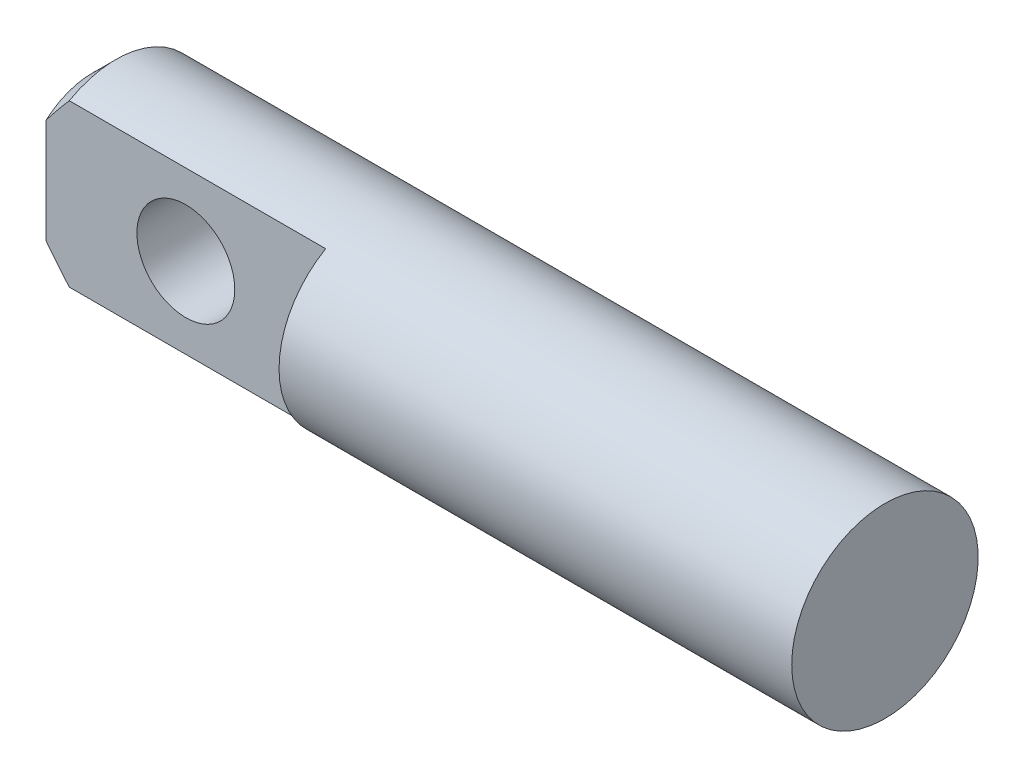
ISO-10303-21;
HEADER;
FILE_DESCRIPTION(('STEP AP214'),'2;1');
FILE_NAME('part.step','',(''),(''),'','','');
FILE_SCHEMA(('AUTOMOTIVE_DESIGN { 1 0 10303 214 1 1 1 1 }'));
ENDSEC;
DATA;
#1=APPLICATION_CONTEXT('core data for automotive mechanical design processes');
#2=APPLICATION_PROTOCOL_DEFINITION('international standard','automotive_design',2000,#1);
#3=PRODUCT_CONTEXT('',#1,'mechanical');
#4=PRODUCT('Part','Part','',(#3));
#5=PRODUCT_RELATED_PRODUCT_CATEGORY('part','',(#4));
#6=PRODUCT_DEFINITION_FORMATION('','',#4);
#7=PRODUCT_DEFINITION_CONTEXT('part definition',#1,'design');
#8=PRODUCT_DEFINITION('design','',#6,#7);
#9=PRODUCT_DEFINITION_SHAPE('','',#8);
#10=(LENGTH_UNIT() NAMED_UNIT(*) SI_UNIT(.MILLI.,.METRE.));
#11=(NAMED_UNIT(*) PLANE_ANGLE_UNIT() SI_UNIT($,.RADIAN.));
#12=(NAMED_UNIT(*) SI_UNIT($,.STERADIAN.) SOLID_ANGLE_UNIT());
#13=UNCERTAINTY_MEASURE_WITH_UNIT(LENGTH_MEASURE(1.E-05),#10,'distance_accuracy_value','');
#14=(GEOMETRIC_REPRESENTATION_CONTEXT(3) GLOBAL_UNCERTAINTY_ASSIGNED_CONTEXT((#13)) GLOBAL_UNIT_ASSIGNED_CONTEXT((#10,
#11,#12)) REPRESENTATION_CONTEXT('',''));
#15=CARTESIAN_POINT('',(0.,0.,0.));
#16=DIRECTION('',(0.,0.,1.));
#17=DIRECTION('',(1.,0.,0.));
#18=AXIS2_PLACEMENT_3D('',#15,#16,#17);
#19=CARTESIAN_POINT('',(0.,0.,0.));
#20=DIRECTION('',(1.,0.,0.));
#21=DIRECTION('',(0.,0.,-1.));
#22=AXIS2_PLACEMENT_3D('',#19,#20,#21);
#23=PLANE('',#22);
#24=CARTESIAN_POINT('',(0.,0.,0.));
#25=DIRECTION('',(-1.,0.,0.));
#26=DIRECTION('',(0.,0.,1.));
#27=AXIS2_PLACEMENT_3D('',#24,#25,#26);
#28=CIRCLE('',#27,1.5);
#29=CARTESIAN_POINT('',(0.,1.11803398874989,1.));
#30=VERTEX_POINT('',#29);
#31=CARTESIAN_POINT('',(0.,-1.11803398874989,1.));
#32=VERTEX_POINT('',#31);
#33=EDGE_CURVE('E11',#30,#32,#28,.T.);
#34=ORIENTED_EDGE('',*,*,#33,.T.);
#35=DIRECTION('',(0.,-1.,0.));
#36=VECTOR('',#35,1.);
#37=CARTESIAN_POINT('',(0.,1.73205080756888,1.));
#38=LINE('',#37,#36);
#39=EDGE_CURVE('E68',#30,#32,#38,.T.);
#40=ORIENTED_EDGE('',*,*,#39,.F.);
#41=EDGE_LOOP('',(#34,#40));
#42=FACE_BOUND('',#41,.T.);
#43=ADVANCED_FACE('F32',(#42),#23,.F.);
#44=CARTESIAN_POINT('',(0.5,0.,0.));
#45=DIRECTION('',(1.,0.,0.));
#46=DIRECTION('',(0.,0.,-1.));
#47=AXIS2_PLACEMENT_3D('',#44,#45,#46);
#48=CONICAL_SURFACE('',#47,2.,0.785398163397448);
#49=CARTESIAN_POINT('',(0.5,0.,0.));
#50=DIRECTION('',(-1.,0.,0.));
#51=DIRECTION('',(0.,0.,1.));
#52=AXIS2_PLACEMENT_3D('',#49,#50,#51);
#53=CIRCLE('',#52,2.);
#54=CARTESIAN_POINT('',(0.5,1.73205080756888,1.));
#55=VERTEX_POINT('',#54);
#56=CARTESIAN_POINT('',(0.5,-1.73205080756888,1.));
#57=VERTEX_POINT('',#56);
#58=EDGE_CURVE('E39',#55,#57,#53,.T.);
#59=ORIENTED_EDGE('',*,*,#58,.T.);
#60=CARTESIAN_POINT('',(2.46057398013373,-3.83225080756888,1.));
#61=CARTESIAN_POINT('',(2.37587400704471,-3.74471120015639,1.));
#62=CARTESIAN_POINT('',(2.2912658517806,-3.65708252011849,1.));
#63=CARTESIAN_POINT('',(2.12228498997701,-3.4815963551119,1.));
#64=CARTESIAN_POINT('',(2.03791228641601,-3.39373886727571,1.));
#65=CARTESIAN_POINT('',(1.78513969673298,-3.12965797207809,1.));
#66=CARTESIAN_POINT('',(1.61717451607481,-2.95301808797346,1.));
#67=CARTESIAN_POINT('',(1.28648900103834,-2.60155131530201,1.));
#68=CARTESIAN_POINT('',(1.12373125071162,-2.42675985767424,1.));
#69=CARTESIAN_POINT('',(0.882095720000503,-2.16232006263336,1.));
#70=CARTESIAN_POINT('',(0.801976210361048,-2.07380805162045,1.));
#71=CARTESIAN_POINT('',(0.642927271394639,-1.89572176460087,1.));
#72=CARTESIAN_POINT('',(0.563997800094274,-1.80614752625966,1.));
#73=CARTESIAN_POINT('',(0.438831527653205,-1.6612689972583,1.));
#74=CARTESIAN_POINT('',(0.39203362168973,-1.60645005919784,1.));
#75=CARTESIAN_POINT('',(0.299278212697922,-1.49609455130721,1.));
#76=CARTESIAN_POINT('',(0.253320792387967,-1.44055791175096,1.));
#77=CARTESIAN_POINT('',(0.162051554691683,-1.32797390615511,1.));
#78=CARTESIAN_POINT('',(0.116751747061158,-1.27091676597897,1.));
#79=CARTESIAN_POINT('',(0.0277454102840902,-1.15557501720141,1.));
#80=CARTESIAN_POINT('',(-0.0159612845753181,-1.09729053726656,1.));
#81=CARTESIAN_POINT('',(-0.101758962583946,-0.978170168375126,1.));
#82=CARTESIAN_POINT('',(-0.143814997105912,-0.917308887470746,1.));
#83=CARTESIAN_POINT('',(-0.224490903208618,-0.793192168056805,1.));
#84=CARTESIAN_POINT('',(-0.263106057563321,-0.729933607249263,1.));
#85=CARTESIAN_POINT('',(-0.334439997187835,-0.601150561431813,1.));
#86=CARTESIAN_POINT('',(-0.367226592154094,-0.535664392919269,1.));
#87=CARTESIAN_POINT('',(-0.424260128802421,-0.401101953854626,1.));
#88=CARTESIAN_POINT('',(-0.448535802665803,-0.332038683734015,1.));
#89=CARTESIAN_POINT('',(-0.474733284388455,-0.228445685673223,1.));
#90=CARTESIAN_POINT('',(-0.481668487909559,-0.19518216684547,1.));
#91=CARTESIAN_POINT('',(-0.492365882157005,-0.12813924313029,1.));
#92=CARTESIAN_POINT('',(-0.496128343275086,-0.0943598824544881,1.));
#93=CARTESIAN_POINT('',(-0.500211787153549,-0.0266892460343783,1.));
#94=CARTESIAN_POINT('',(-0.50054295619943,0.00720139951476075,1.));
#95=CARTESIAN_POINT('',(-0.497775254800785,0.0748350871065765,1.));
#96=CARTESIAN_POINT('',(-0.494676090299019,0.108578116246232,1.));
#97=CARTESIAN_POINT('',(-0.480599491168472,0.20851256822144,1.));
#98=CARTESIAN_POINT('',(-0.464876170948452,0.27406631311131,1.));
#99=CARTESIAN_POINT('',(-0.434150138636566,0.370108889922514,1.));
#100=CARTESIAN_POINT('',(-0.422668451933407,0.401841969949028,1.));
#101=CARTESIAN_POINT('',(-0.39774448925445,0.464529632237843,1.));
#102=CARTESIAN_POINT('',(-0.384302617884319,0.495484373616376,1.));
#103=CARTESIAN_POINT('',(-0.341227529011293,0.58802936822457,1.));
#104=CARTESIAN_POINT('',(-0.309132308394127,0.648465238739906,1.));
#105=CARTESIAN_POINT('',(-0.240704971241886,0.766913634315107,1.));
#106=CARTESIAN_POINT('',(-0.204367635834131,0.824923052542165,1.));
#107=CARTESIAN_POINT('',(-0.128719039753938,0.939284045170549,1.));
#108=CARTESIAN_POINT('',(-0.0893965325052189,0.995628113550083,1.));
#109=CARTESIAN_POINT('',(-0.00880708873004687,1.10685190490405,1.));
#110=CARTESIAN_POINT('',(0.0324588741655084,1.1617323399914,1.));
#111=CARTESIAN_POINT('',(0.116950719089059,1.27112215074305,1.));
#112=CARTESIAN_POINT('',(0.160195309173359,1.32561700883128,1.));
#113=CARTESIAN_POINT('',(0.247749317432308,1.4337464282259,1.));
#114=CARTESIAN_POINT('',(0.292058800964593,1.48738093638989,1.));
#115=CARTESIAN_POINT('',(0.425958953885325,1.64702819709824,1.));
#116=CARTESIAN_POINT('',(0.51673012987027,1.75204921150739,1.));
#117=CARTESIAN_POINT('',(0.684562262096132,1.94266875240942,1.));
#118=CARTESIAN_POINT('',(0.761327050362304,2.02853055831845,1.));
#119=CARTESIAN_POINT('',(0.915795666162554,2.19940947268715,1.));
#120=CARTESIAN_POINT('',(0.993499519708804,2.2844265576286,1.));
#121=CARTESIAN_POINT('',(1.22775950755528,2.53871324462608,1.));
#122=CARTESIAN_POINT('',(1.38531948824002,2.70705628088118,1.));
#123=CARTESIAN_POINT('',(1.69545643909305,3.03540360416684,1.));
#124=CARTESIAN_POINT('',(1.84797198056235,3.1954661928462,1.));
#125=CARTESIAN_POINT('',(2.077347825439,3.43481167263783,1.));
#126=CARTESIAN_POINT('',(2.1538640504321,3.51442460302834,1.));
#127=CARTESIAN_POINT('',(2.307086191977,3.67346650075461,1.));
#128=CARTESIAN_POINT('',(2.38379210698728,3.75289546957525,1.));
#129=CARTESIAN_POINT('',(2.46057398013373,3.83225080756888,1.));
#130=B_SPLINE_CURVE_WITH_KNOTS('',3,(#60,#61,#62,#63,#64,#65,#66,#67,#68,#69,#70,#71,#72,#73,
#74,#75,#76,#77,#78,#79,#80,#81,#82,#83,#84,#85,#86,#87,#88,#89,#90,#91,#92,#93,#94,#95,#96,#97,
#98,#99,#100,#101,#102,#103,#104,#105,#106,#107,#108,#109,#110,#111,#112,#113,#114,#115,#116,
#117,#118,#119,#120,#121,#122,#123,#124,#125,#126,#127,#128,#129),.UNSPECIFIED.,.F.,.F.,(4,2,2,
2,2,2,2,2,2,2,2,2,2,2,2,2,2,2,2,2,2,2,2,2,2,2,2,2,2,2,2,2,2,2,4),(0.,0.365425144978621,
0.730854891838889,1.46209867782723,2.17857445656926,2.536732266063,2.89487741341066,
3.1111036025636,3.32735095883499,3.54589088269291,3.76440800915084,3.98626822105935,
4.20842805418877,4.42780463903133,4.6464333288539,4.74824013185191,4.8500382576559,
4.95153409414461,5.05303863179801,5.25410882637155,5.35530965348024,5.45648962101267,
5.66148363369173,5.86673255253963,6.07279728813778,6.27875986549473,6.48744761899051,
6.69614821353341,7.11253886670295,7.45805536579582,7.80358145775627,8.49528494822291,
9.15855260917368,9.48981739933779,9.82107950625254),.UNSPECIFIED.);
#131=EDGE_CURVE('E52',#57,#32,#130,.T.);
#132=ORIENTED_EDGE('',*,*,#131,.T.);
#133=ORIENTED_EDGE('',*,*,#33,.F.);
#134=EDGE_CURVE('E80',#30,#55,#130,.T.);
#135=ORIENTED_EDGE('',*,*,#134,.T.);
#136=EDGE_LOOP('',(#59,#132,#133,#135));
#137=FACE_BOUND('',#136,.T.);
#138=ADVANCED_FACE('F90',(#137),#48,.T.);
#139=CARTESIAN_POINT('',(0.,0.,0.));
#140=DIRECTION('',(-1.,0.,0.));
#141=DIRECTION('',(0.,0.,1.));
#142=AXIS2_PLACEMENT_3D('',#139,#140,#141);
#143=CYLINDRICAL_SURFACE('',#142,2.);
#144=CARTESIAN_POINT('',(4.05,0.,-2.));
#145=CARTESIAN_POINT('',(4.04999642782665,0.0548641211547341,-1.99999683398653));
#146=CARTESIAN_POINT('',(4.04567479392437,0.109783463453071,-1.99771881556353));
#147=CARTESIAN_POINT('',(4.02858955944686,0.217977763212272,-1.98883014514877));
#148=CARTESIAN_POINT('',(4.01581212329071,0.271249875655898,-1.98221239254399));
#149=CARTESIAN_POINT('',(3.98246345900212,0.374423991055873,-1.96533181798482));
#150=CARTESIAN_POINT('',(3.96192347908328,0.424338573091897,-1.95508362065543));
#151=CARTESIAN_POINT('',(3.91380632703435,0.519927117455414,-1.93186406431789));
#152=CARTESIAN_POINT('',(3.88622926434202,0.565601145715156,-1.9188927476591));
#153=CARTESIAN_POINT('',(3.82280240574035,0.654735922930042,-1.89040981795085));
#154=CARTESIAN_POINT('',(3.78653272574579,0.697862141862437,-1.87478813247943));
#155=CARTESIAN_POINT('',(3.70766284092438,0.777732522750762,-1.84309034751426));
#156=CARTESIAN_POINT('',(3.66505733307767,0.814471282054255,-1.8270138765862));
#157=CARTESIAN_POINT('',(3.57026208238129,0.883766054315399,-1.79458801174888));
#158=CARTESIAN_POINT('',(3.51755955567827,0.915672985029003,-1.77833825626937));
#159=CARTESIAN_POINT('',(3.40661050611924,0.97003900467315,-1.74927996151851));
#160=CARTESIAN_POINT('',(3.34836824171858,0.992505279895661,-1.73646880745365));
#161=CARTESIAN_POINT('',(3.23163455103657,1.02581389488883,-1.71699156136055));
#162=CARTESIAN_POINT('',(3.17338254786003,1.03729066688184,-1.70999366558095));
#163=CARTESIAN_POINT('',(3.05539598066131,1.05021032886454,-1.70209360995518));
#164=CARTESIAN_POINT('',(2.99566326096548,1.05166512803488,-1.70118421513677));
#165=CARTESIAN_POINT('',(2.88511792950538,1.04496287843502,-1.70530281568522));
#166=CARTESIAN_POINT('',(2.83419117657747,1.03807876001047,-1.70954469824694));
#167=CARTESIAN_POINT('',(2.73435992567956,1.01712241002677,-1.72209458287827));
#168=CARTESIAN_POINT('',(2.68545620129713,1.00304745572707,-1.73040412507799));
#169=CARTESIAN_POINT('',(2.58966972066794,0.96788100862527,-1.75032008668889));
#170=CARTESIAN_POINT('',(2.54285841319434,0.946636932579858,-1.76199731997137));
#171=CARTESIAN_POINT('',(2.4532306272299,0.897858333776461,-1.78734588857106));
#172=CARTESIAN_POINT('',(2.4104159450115,0.870321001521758,-1.80101811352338));
#173=CARTESIAN_POINT('',(2.3236097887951,0.805196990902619,-1.8311522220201));
#174=CARTESIAN_POINT('',(2.28031136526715,0.766739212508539,-1.84773486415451));
#175=CARTESIAN_POINT('',(2.20047253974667,0.683082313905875,-1.88026963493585));
#176=CARTESIAN_POINT('',(2.16393602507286,0.637879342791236,-1.89622139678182));
#177=CARTESIAN_POINT('',(2.09670893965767,0.538834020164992,-1.9267817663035));
#178=CARTESIAN_POINT('',(2.06646076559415,0.48464945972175,-1.94126499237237));
#179=CARTESIAN_POINT('',(2.0157686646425,0.371011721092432,-1.96614386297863));
#180=CARTESIAN_POINT('',(1.99531622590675,0.311563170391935,-1.97654305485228));
#181=CARTESIAN_POINT('',(1.96661366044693,0.194698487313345,-1.9912936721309));
#182=CARTESIAN_POINT('',(1.9574465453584,0.137565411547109,-1.99609753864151));
#183=CARTESIAN_POINT('',(1.94865342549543,0.0223804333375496,-2.00070334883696));
#184=CARTESIAN_POINT('',(1.94902217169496,-0.0356709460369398,-2.00050804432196));
#185=CARTESIAN_POINT('',(1.95881362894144,-0.145639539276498,-1.9953836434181));
#186=CARTESIAN_POINT('',(1.96744311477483,-0.197649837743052,-1.99086929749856));
#187=CARTESIAN_POINT('',(1.99221937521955,-0.29936409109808,-1.97813273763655));
#188=CARTESIAN_POINT('',(2.0083669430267,-0.349067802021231,-1.96991013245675));
#189=CARTESIAN_POINT('',(2.04807212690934,-0.446276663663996,-1.95022110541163));
#190=CARTESIAN_POINT('',(2.07181153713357,-0.493691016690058,-1.93867588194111));
#191=CARTESIAN_POINT('',(2.1258095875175,-0.584005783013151,-1.91341051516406));
#192=CARTESIAN_POINT('',(2.15607084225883,-0.626904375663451,-1.89968950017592));
#193=CARTESIAN_POINT('',(2.22591727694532,-0.711777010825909,-1.86965424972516));
#194=CARTESIAN_POINT('',(2.26614906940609,-0.753176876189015,-1.85321912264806));
#195=CARTESIAN_POINT('',(2.35292568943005,-0.828924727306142,-1.82060103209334));
#196=CARTESIAN_POINT('',(2.39947593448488,-0.863266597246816,-1.80441829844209));
#197=CARTESIAN_POINT('',(2.50116779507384,-0.925987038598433,-1.77309145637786));
#198=CARTESIAN_POINT('',(2.55666411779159,-0.953860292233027,-1.75807501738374));
#199=CARTESIAN_POINT('',(2.6725806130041,-0.999581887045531,-1.73249279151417));
#200=CARTESIAN_POINT('',(2.73299376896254,-1.01744423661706,-1.72192079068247));
#201=CARTESIAN_POINT('',(2.85074524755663,-1.04089614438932,-1.70783667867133));
#202=CARTESIAN_POINT('',(2.90780551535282,-1.04751606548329,-1.70373469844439));
#203=CARTESIAN_POINT('',(3.02234654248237,-1.05132201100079,-1.70139066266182));
#204=CARTESIAN_POINT('',(3.07982702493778,-1.04851377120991,-1.70314504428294));
#205=CARTESIAN_POINT('',(3.1865848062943,-1.03452866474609,-1.71166640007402));
#206=CARTESIAN_POINT('',(3.2360471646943,-1.02434795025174,-1.71783575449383));
#207=CARTESIAN_POINT('',(3.33248041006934,-0.997229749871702,-1.7337180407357));
#208=CARTESIAN_POINT('',(3.37945040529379,-0.980289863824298,-1.74343223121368));
#209=CARTESIAN_POINT('',(3.47299828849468,-0.938913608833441,-1.76607769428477));
#210=CARTESIAN_POINT('',(3.51934879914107,-0.914058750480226,-1.77917806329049));
#211=CARTESIAN_POINT('',(3.60753120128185,-0.857985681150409,-1.80688642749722));
#212=CARTESIAN_POINT('',(3.6493606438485,-0.826764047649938,-1.8214952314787));
#213=CARTESIAN_POINT('',(3.73336162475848,-0.753783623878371,-1.85299725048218));
#214=CARTESIAN_POINT('',(3.77477596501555,-0.711163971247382,-1.86992628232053));
#215=CARTESIAN_POINT('',(3.85007948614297,-0.619191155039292,-1.90236151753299));
#216=CARTESIAN_POINT('',(3.88396403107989,-0.569833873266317,-1.91786684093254));
#217=CARTESIAN_POINT('',(3.94371380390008,-0.464378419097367,-1.94612151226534));
#218=CARTESIAN_POINT('',(3.96941012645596,-0.408167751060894,-1.95881135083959));
#219=CARTESIAN_POINT('',(4.01063714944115,-0.291412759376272,-1.97953693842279));
#220=CARTESIAN_POINT('',(4.02619547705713,-0.230880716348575,-1.98758532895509));
#221=CARTESIAN_POINT('',(4.0408249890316,-0.141380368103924,-1.99519548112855));
#222=CARTESIAN_POINT('',(4.04425957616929,-0.113250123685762,-1.9969913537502));
#223=CARTESIAN_POINT('',(4.04884802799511,-0.0567515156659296,-1.99939444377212));
#224=CARTESIAN_POINT('',(4.05000184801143,-0.0283831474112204,-2.00000163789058));
#225=CARTESIAN_POINT('',(4.05,0.,-2.));
#226=B_SPLINE_CURVE_WITH_KNOTS('',3,(#144,#145,#146,#147,#148,#149,#150,#151,#152,#153,#154,
#155,#156,#157,#158,#159,#160,#161,#162,#163,#164,#165,#166,#167,#168,#169,#170,#171,#172,#173,
#174,#175,#176,#177,#178,#179,#180,#181,#182,#183,#184,#185,#186,#187,#188,#189,#190,#191,#192,
#193,#194,#195,#196,#197,#198,#199,#200,#201,#202,#203,#204,#205,#206,#207,#208,#209,#210,#211,
#212,#213,#214,#215,#216,#217,#218,#219,#220,#221,#222,#223,#224,#225),.UNSPECIFIED.,.T.,.F.,(4,
2,2,2,2,2,2,2,2,2,2,2,2,2,2,2,2,2,2,2,2,2,2,2,2,2,2,2,2,2,2,2,2,2,2,2,2,2,2,2,4),(0.,
0.164477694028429,0.329225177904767,0.493316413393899,0.657405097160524,0.832113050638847,
1.00696806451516,1.19715271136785,1.38719232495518,1.56544714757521,1.7434901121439,
1.89746165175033,2.05149153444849,2.209031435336,2.36664180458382,2.54658744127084,
2.72663620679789,2.91677576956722,3.10674981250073,3.27997148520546,3.45309780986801,
3.6111101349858,3.76913913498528,3.9312780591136,4.09348210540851,4.27278509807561,
4.45224280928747,4.64288973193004,4.83326920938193,5.0050093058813,5.17664494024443,
5.32860681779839,5.48062270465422,5.64259984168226,5.8046642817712,5.98920626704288,
6.17386155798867,6.36211058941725,6.5498444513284,6.63493290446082,6.72002302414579),.UNSPECIFIED.);
#227=CARTESIAN_POINT('',(4.05,0.,-2.));
#228=VERTEX_POINT('',#227);
#229=EDGE_CURVE('E106',#228,#228,#226,.T.);
#230=ORIENTED_EDGE('',*,*,#229,.T.);
#231=EDGE_LOOP('',(#230));
#232=FACE_BOUND('',#231,.T.);
#233=CARTESIAN_POINT('',(6.,0.,0.));
#234=DIRECTION('',(-1.,0.,0.));
#235=DIRECTION('',(0.,0.,1.));
#236=AXIS2_PLACEMENT_3D('',#233,#234,#235);
#237=CIRCLE('',#236,2.);
#238=CARTESIAN_POINT('',(6.,-1.73205080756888,1.));
#239=VERTEX_POINT('',#238);
#240=CARTESIAN_POINT('',(6.,1.73205080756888,1.));
#241=VERTEX_POINT('',#240);
#242=EDGE_CURVE('E64',#239,#241,#237,.T.);
#243=ORIENTED_EDGE('',*,*,#242,.F.);
#244=DIRECTION('',(-1.,0.,0.));
#245=VECTOR('',#244,1.);
#246=CARTESIAN_POINT('',(6.,-1.73205080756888,1.));
#247=LINE('',#246,#245);
#248=EDGE_CURVE('E73',#239,#57,#247,.T.);
#249=ORIENTED_EDGE('',*,*,#248,.T.);
#250=ORIENTED_EDGE('',*,*,#58,.F.);
#251=DIRECTION('',(-1.,0.,0.));
#252=VECTOR('',#251,1.);
#253=CARTESIAN_POINT('',(6.,1.73205080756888,1.));
#254=LINE('',#253,#252);
#255=EDGE_CURVE('E71',#241,#55,#254,.T.);
#256=ORIENTED_EDGE('',*,*,#255,.F.);
#257=EDGE_LOOP('',(#243,#249,#250,#256));
#258=FACE_BOUND('',#257,.T.);
#259=CARTESIAN_POINT('',(17.,0.,0.));
#260=DIRECTION('',(-1.,0.,0.));
#261=DIRECTION('',(0.,0.,1.));
#262=AXIS2_PLACEMENT_3D('',#259,#260,#261);
#263=CIRCLE('',#262,2.);
#264=CARTESIAN_POINT('',(17.,0.,2.));
#265=VERTEX_POINT('',#264);
#266=EDGE_CURVE('E89',#265,#265,#263,.T.);
#267=ORIENTED_EDGE('',*,*,#266,.T.);
#268=EDGE_LOOP('',(#267));
#269=FACE_BOUND('',#268,.T.);
#270=ADVANCED_FACE('F76',(#232,#258,#269),#143,.T.);
#271=CARTESIAN_POINT('',(17.,2.,0.));
#272=DIRECTION('',(-1.,0.,0.));
#273=DIRECTION('',(0.,0.,1.));
#274=AXIS2_PLACEMENT_3D('',#271,#272,#273);
#275=PLANE('',#274);
#276=ORIENTED_EDGE('',*,*,#266,.F.);
#277=EDGE_LOOP('',(#276));
#278=FACE_BOUND('',#277,.T.);
#279=ADVANCED_FACE('F97',(#278),#275,.F.);
#280=CARTESIAN_POINT('',(6.,1.73205080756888,1.));
#281=DIRECTION('',(0.,0.,-1.));
#282=DIRECTION('',(-1.,0.,0.));
#283=AXIS2_PLACEMENT_3D('',#280,#281,#282);
#284=PLANE('',#283);
#285=CARTESIAN_POINT('',(3.,0.,1.));
#286=DIRECTION('',(0.,0.,1.));
#287=DIRECTION('',(1.,0.,0.));
#288=AXIS2_PLACEMENT_3D('',#285,#286,#287);
#289=CIRCLE('',#288,1.05);
#290=CARTESIAN_POINT('',(4.05,0.,1.));
#291=VERTEX_POINT('',#290);
#292=EDGE_CURVE('E111',#291,#291,#289,.T.);
#293=ORIENTED_EDGE('',*,*,#292,.F.);
#294=EDGE_LOOP('',(#293));
#295=FACE_BOUND('',#294,.T.);
#296=ORIENTED_EDGE('',*,*,#248,.F.);
#297=DIRECTION('',(0.,-1.,0.));
#298=VECTOR('',#297,1.);
#299=CARTESIAN_POINT('',(6.,1.73205080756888,1.));
#300=LINE('',#299,#298);
#301=EDGE_CURVE('E45',#241,#239,#300,.T.);
#302=ORIENTED_EDGE('',*,*,#301,.F.);
#303=ORIENTED_EDGE('',*,*,#255,.T.);
#304=ORIENTED_EDGE('',*,*,#134,.F.);
#305=ORIENTED_EDGE('',*,*,#39,.T.);
#306=ORIENTED_EDGE('',*,*,#131,.F.);
#307=EDGE_LOOP('',(#296,#302,#303,#304,#305,#306));
#308=FACE_BOUND('',#307,.T.);
#309=ADVANCED_FACE('F70',(#295,#308),#284,.F.);
#310=CARTESIAN_POINT('',(6.,0.,0.));
#311=DIRECTION('',(-1.,0.,0.));
#312=DIRECTION('',(0.,0.,1.));
#313=AXIS2_PLACEMENT_3D('',#310,#311,#312);
#314=PLANE('',#313);
#315=ORIENTED_EDGE('',*,*,#242,.T.);
#316=ORIENTED_EDGE('',*,*,#301,.T.);
#317=EDGE_LOOP('',(#315,#316));
#318=FACE_BOUND('',#317,.T.);
#319=ADVANCED_FACE('F65',(#318),#314,.T.);
#320=CARTESIAN_POINT('',(3.,0.,-2.));
#321=DIRECTION('',(0.,0.,1.));
#322=DIRECTION('',(1.,0.,0.));
#323=AXIS2_PLACEMENT_3D('',#320,#321,#322);
#324=CYLINDRICAL_SURFACE('',#323,1.05);
#325=ORIENTED_EDGE('',*,*,#292,.T.);
#326=EDGE_LOOP('',(#325));
#327=FACE_BOUND('',#326,.T.);
#328=ORIENTED_EDGE('',*,*,#229,.F.);
#329=EDGE_LOOP('',(#328));
#330=FACE_BOUND('',#329,.T.);
#331=ADVANCED_FACE('F112',(#327,#330),#324,.F.);
#332=CLOSED_SHELL('',(#43,#138,#270,#279,#309,#319,#331));
#333=MANIFOLD_SOLID_BREP('B2',#332);
#334=ADVANCED_BREP_SHAPE_REPRESENTATION('',(#18,#333),#14);
#335=SHAPE_DEFINITION_REPRESENTATION(#9,#334);
ENDSEC;
END-ISO-10303-21;
